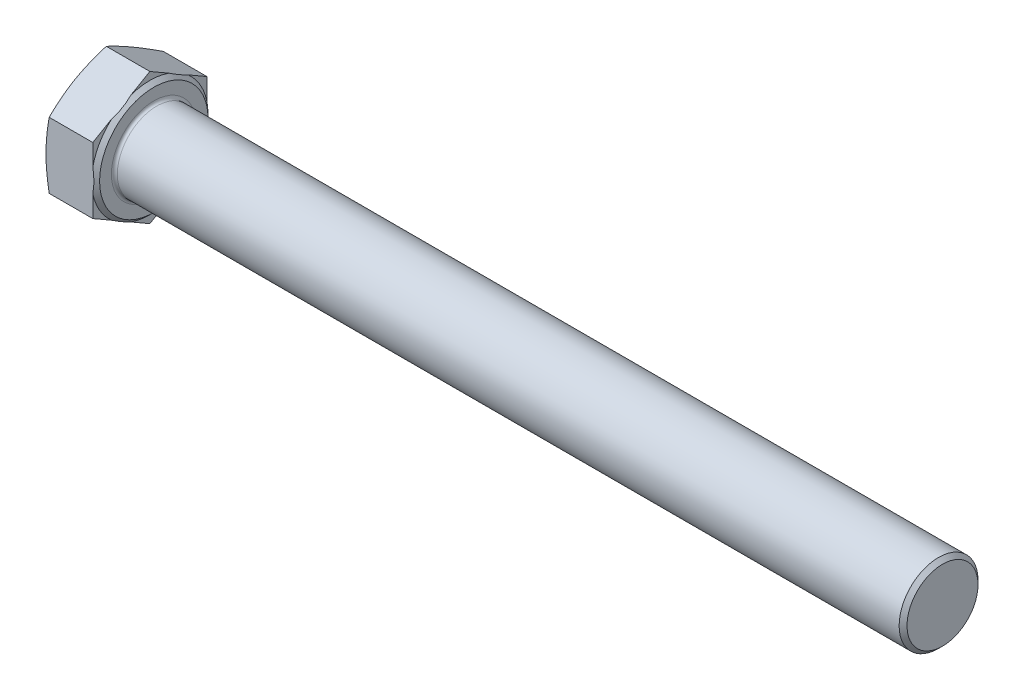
ISO-10303-21;
HEADER;
FILE_DESCRIPTION(('STEP AP214'),'2;1');
FILE_NAME('part.step','',(''),(''),'','','');
FILE_SCHEMA(('AUTOMOTIVE_DESIGN { 1 0 10303 214 1 1 1 1 }'));
ENDSEC;
DATA;
#1=APPLICATION_CONTEXT('core data for automotive mechanical design processes');
#2=APPLICATION_PROTOCOL_DEFINITION('international standard','automotive_design',2000,#1);
#3=PRODUCT_CONTEXT('',#1,'mechanical');
#4=PRODUCT('Part','Part','',(#3));
#5=PRODUCT_RELATED_PRODUCT_CATEGORY('part','',(#4));
#6=PRODUCT_DEFINITION_FORMATION('','',#4);
#7=PRODUCT_DEFINITION_CONTEXT('part definition',#1,'design');
#8=PRODUCT_DEFINITION('design','',#6,#7);
#9=PRODUCT_DEFINITION_SHAPE('','',#8);
#10=(LENGTH_UNIT() NAMED_UNIT(*) SI_UNIT(.MILLI.,.METRE.));
#11=(NAMED_UNIT(*) PLANE_ANGLE_UNIT() SI_UNIT($,.RADIAN.));
#12=(NAMED_UNIT(*) SI_UNIT($,.STERADIAN.) SOLID_ANGLE_UNIT());
#13=UNCERTAINTY_MEASURE_WITH_UNIT(LENGTH_MEASURE(1.E-05),#10,'distance_accuracy_value','');
#14=(GEOMETRIC_REPRESENTATION_CONTEXT(3) GLOBAL_UNCERTAINTY_ASSIGNED_CONTEXT((#13)) GLOBAL_UNIT_ASSIGNED_CONTEXT((#10,
#11,#12)) REPRESENTATION_CONTEXT('',''));
#15=CARTESIAN_POINT('',(0.,0.,0.));
#16=DIRECTION('',(0.,0.,1.));
#17=DIRECTION('',(1.,0.,0.));
#18=AXIS2_PLACEMENT_3D('',#15,#16,#17);
#19=CARTESIAN_POINT('',(10.29,-13.3714322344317,0.));
#20=DIRECTION('',(-1.,0.,0.));
#21=DIRECTION('',(0.,0.,1.));
#22=AXIS2_PLACEMENT_3D('',#19,#20,#21);
#23=PLANE('',#22);
#24=CARTESIAN_POINT('',(10.29,0.,0.));
#25=DIRECTION('',(-1.,0.,0.));
#26=DIRECTION('',(0.,0.,1.));
#27=AXIS2_PLACEMENT_3D('',#24,#25,#26);
#28=CIRCLE('',#27,8.6);
#29=CARTESIAN_POINT('',(10.29,0.,8.6));
#30=VERTEX_POINT('',#29);
#31=EDGE_CURVE('E11',#30,#30,#28,.T.);
#32=ORIENTED_EDGE('',*,*,#31,.T.);
#33=EDGE_LOOP('',(#32));
#34=FACE_BOUND('',#33,.T.);
#35=CARTESIAN_POINT('',(10.29,0.,0.));
#36=DIRECTION('',(-1.,0.,0.));
#37=DIRECTION('',(0.,0.,1.));
#38=AXIS2_PLACEMENT_3D('',#35,#36,#37);
#39=CIRCLE('',#38,11.);
#40=CARTESIAN_POINT('',(10.29,0.,11.));
#41=VERTEX_POINT('',#40);
#42=EDGE_CURVE('E560',#41,#41,#39,.T.);
#43=ORIENTED_EDGE('',*,*,#42,.F.);
#44=EDGE_LOOP('',(#43));
#45=FACE_BOUND('',#44,.T.);
#46=ADVANCED_FACE('F34',(#34,#45),#23,.F.);
#47=CARTESIAN_POINT('',(10.29,-13.3714322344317,0.));
#48=DIRECTION('',(0.,0.866025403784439,0.5));
#49=DIRECTION('',(0.,-0.5,0.866025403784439));
#50=AXIS2_PLACEMENT_3D('',#47,#48,#49);
#51=PLANE('',#50);
#52=CARTESIAN_POINT('',(0.652070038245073,-6.68560064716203,-11.5802));
#53=CARTESIAN_POINT('',(0.551258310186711,-6.9624803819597,-11.1006302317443));
#54=CARTESIAN_POINT('',(0.459552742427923,-7.24027312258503,-10.6194790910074));
#55=CARTESIAN_POINT('',(0.29821116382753,-7.79766476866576,-9.6540484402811));
#56=CARTESIAN_POINT('',(0.228592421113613,-8.07726491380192,-9.16976678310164));
#57=CARTESIAN_POINT('',(0.11598616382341,-8.63516857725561,-8.20344929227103));
#58=CARTESIAN_POINT('',(0.0727530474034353,-8.91345935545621,-7.72143552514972));
#59=CARTESIAN_POINT('',(0.0147653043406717,-9.47069166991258,-6.75628084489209));
#60=CARTESIAN_POINT('',(0.,-9.74963292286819,-6.27314042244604));
#61=CARTESIAN_POINT('',(0.,-10.3075154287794,-5.30685957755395));
#62=CARTESIAN_POINT('',(0.0147653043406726,-10.586456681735,-4.82371915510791));
#63=CARTESIAN_POINT('',(0.0727530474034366,-11.1436889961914,-3.85856447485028));
#64=CARTESIAN_POINT('',(0.115986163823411,-11.421979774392,-3.37655070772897));
#65=CARTESIAN_POINT('',(0.228592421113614,-11.9798834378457,-2.41023321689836));
#66=CARTESIAN_POINT('',(0.29821116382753,-12.2594835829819,-1.92595155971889));
#67=CARTESIAN_POINT('',(0.459552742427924,-12.8168752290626,-0.960520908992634));
#68=CARTESIAN_POINT('',(0.551258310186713,-13.0946679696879,-0.479369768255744));
#69=CARTESIAN_POINT('',(0.652070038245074,-13.3715477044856,0.000200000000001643));
#70=B_SPLINE_CURVE_WITH_KNOTS('',3,(#52,#53,#54,#55,#56,#57,#58,#59,#60,#61,#62,#63,#64,#65,#66,
#67,#68,#69),.UNSPECIFIED.,.F.,.F.,(4,2,2,2,2,2,2,2,4),(0.,1.68875729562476,3.37883167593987,
5.0529245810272,6.72638944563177,8.39985431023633,10.0739472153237,11.7640215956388,
13.4527788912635),.UNSPECIFIED.);
#71=CARTESIAN_POINT('',(0.652028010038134,-6.68571611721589,-11.58));
#72=VERTEX_POINT('',#71);
#73=CARTESIAN_POINT('',(0.,-10.0285741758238,-5.79));
#74=VERTEX_POINT('',#73);
#75=EDGE_CURVE('E150',#72,#74,#70,.T.);
#76=ORIENTED_EDGE('',*,*,#75,.F.);
#77=DIRECTION('',(-1.,0.,0.));
#78=VECTOR('',#77,1.);
#79=CARTESIAN_POINT('',(10.29,-6.68571611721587,-11.58));
#80=LINE('',#79,#78);
#81=CARTESIAN_POINT('',(9.49,-6.68571611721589,-11.58));
#82=VERTEX_POINT('',#81);
#83=EDGE_CURVE('E179',#82,#72,#80,.T.);
#84=ORIENTED_EDGE('',*,*,#83,.F.);
#85=DIRECTION('',(0.,0.5,-0.866025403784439));
#86=VECTOR('',#85,1.);
#87=CARTESIAN_POINT('',(9.49,-13.3714322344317,0.));
#88=LINE('',#87,#86);
#89=CARTESIAN_POINT('',(9.49,-8.89459886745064,-7.75410284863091));
#90=VERTEX_POINT('',#89);
#91=EDGE_CURVE('E313',#90,#82,#88,.T.);
#92=ORIENTED_EDGE('',*,*,#91,.F.);
#93=CARTESIAN_POINT('',(9.48979999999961,-11.1630696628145,-3.82499617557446));
#94=CARTESIAN_POINT('',(9.5175733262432,-11.0908585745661,-3.95006944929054));
#95=CARTESIAN_POINT('',(9.54287548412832,-11.0184140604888,-4.07554702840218));
#96=CARTESIAN_POINT('',(9.58834130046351,-10.8731166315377,-4.32720955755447));
#97=CARTESIAN_POINT('',(9.60850447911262,-10.8002636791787,-4.45339457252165));
#98=CARTESIAN_POINT('',(9.66099226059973,-10.5811662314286,-4.83288248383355));
#99=CARTESIAN_POINT('',(9.6853020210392,-10.434416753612,-5.08706003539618));
#100=CARTESIAN_POINT('',(9.71138230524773,-10.1424770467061,-5.59271444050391));
#101=CARTESIAN_POINT('',(9.71346189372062,-9.99729355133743,-5.84417963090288));
#102=CARTESIAN_POINT('',(9.69580824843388,-9.70732033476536,-6.34642797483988));
#103=CARTESIAN_POINT('',(9.67608586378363,-9.56253045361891,-6.59721140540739));
#104=CARTESIAN_POINT('',(9.62747524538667,-9.33061919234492,-6.99889349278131));
#105=CARTESIAN_POINT('',(9.60520780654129,-9.24313431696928,-7.15042174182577));
#106=CARTESIAN_POINT('',(9.55311273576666,-9.06834298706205,-7.45316920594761));
#107=CARTESIAN_POINT('',(9.5232529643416,-8.98103892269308,-7.60438428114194));
#108=CARTESIAN_POINT('',(9.4898,-8.89407868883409,-7.75500382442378));
#109=B_SPLINE_CURVE_WITH_KNOTS('',3,(#93,#94,#95,#96,#97,#98,#99,#100,#101,#102,#103,#104,#105,
#106,#107,#108),.UNSPECIFIED.,.F.,.F.,(4,2,2,2,2,2,2,4),(0.,0.441163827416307,0.882368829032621,
1.76498378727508,2.63531157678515,3.50520646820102,4.03420282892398,4.56547691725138),.UNSPECIFIED.);
#110=CARTESIAN_POINT('',(9.49,-11.162549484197,-3.8258971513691));
#111=VERTEX_POINT('',#110);
#112=EDGE_CURVE('E300',#111,#90,#109,.T.);
#113=ORIENTED_EDGE('',*,*,#112,.F.);
#114=CARTESIAN_POINT('',(9.49,-13.3714322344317,0.));
#115=VERTEX_POINT('',#114);
#116=EDGE_CURVE('E310',#115,#111,#88,.T.);
#117=ORIENTED_EDGE('',*,*,#116,.F.);
#118=DIRECTION('',(-1.,0.,0.));
#119=VECTOR('',#118,1.);
#120=CARTESIAN_POINT('',(10.29,-13.3714322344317,0.));
#121=LINE('',#120,#119);
#122=CARTESIAN_POINT('',(0.652028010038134,-13.3714322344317,0.));
#123=VERTEX_POINT('',#122);
#124=EDGE_CURVE('E173',#115,#123,#121,.T.);
#125=ORIENTED_EDGE('',*,*,#124,.T.);
#126=EDGE_CURVE('E269',#74,#123,#70,.T.);
#127=ORIENTED_EDGE('',*,*,#126,.F.);
#128=EDGE_LOOP('',(#76,#84,#92,#113,#117,#125,#127));
#129=FACE_BOUND('',#128,.T.);
#130=ADVANCED_FACE('F36',(#129),#51,.F.);
#131=CARTESIAN_POINT('',(10.29,-6.68571611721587,-11.58));
#132=DIRECTION('',(0.,0.,1.));
#133=DIRECTION('',(0.,-1.,0.));
#134=AXIS2_PLACEMENT_3D('',#131,#132,#133);
#135=PLANE('',#134);
#136=CARTESIAN_POINT('',(3.48417910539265,-17.7014254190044,-11.58));
#137=CARTESIAN_POINT('',(3.32464533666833,-17.1775043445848,-11.58));
#138=CARTESIAN_POINT('',(3.16697311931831,-16.6530058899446,-11.58));
#139=CARTESIAN_POINT('',(2.85638159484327,-15.6025602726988,-11.58));
#140=CARTESIAN_POINT('',(2.70346266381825,-15.0766129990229,-11.58));
#141=CARTESIAN_POINT('',(2.40315314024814,-14.022075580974,-11.58));
#142=CARTESIAN_POINT('',(2.25577339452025,-13.4934823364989,-11.58));
#143=CARTESIAN_POINT('',(1.96826765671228,-12.4343295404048,-11.58));
#144=CARTESIAN_POINT('',(1.82814153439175,-11.903770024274,-11.58));
#145=CARTESIAN_POINT('',(1.55861137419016,-10.846887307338,-11.58));
#146=CARTESIAN_POINT('',(1.42909643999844,-10.3205925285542,-11.58));
#147=CARTESIAN_POINT('',(1.18109321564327,-9.26538406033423,-11.58));
#148=CARTESIAN_POINT('',(1.06260511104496,-8.73647032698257,-11.58));
#149=CARTESIAN_POINT('',(0.839417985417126,-7.67590559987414,-11.58));
#150=CARTESIAN_POINT('',(0.734714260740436,-7.14425560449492,-11.58));
#151=CARTESIAN_POINT('',(0.542284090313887,-6.07786901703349,-11.58));
#152=CARTESIAN_POINT('',(0.454557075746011,-5.54313252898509,-11.58));
#153=CARTESIAN_POINT('',(0.308330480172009,-4.53078638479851,-11.58));
#154=CARTESIAN_POINT('',(0.24765673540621,-4.05349372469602,-11.58));
#155=CARTESIAN_POINT('',(0.144950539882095,-3.09689017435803,-11.58));
#156=CARTESIAN_POINT('',(0.102917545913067,-2.61757934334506,-11.58));
#157=CARTESIAN_POINT('',(0.0395170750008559,-1.65791167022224,-11.58));
#158=CARTESIAN_POINT('',(0.0181349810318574,-1.17755580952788,-11.58));
#159=CARTESIAN_POINT('',(-0.00288111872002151,-0.216363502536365,-11.58));
#160=CARTESIAN_POINT('',(-0.00251527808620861,0.264472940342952,-11.58));
#161=CARTESIAN_POINT('',(0.0200015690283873,1.22806689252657,-11.58));
#162=CARTESIAN_POINT('',(0.0422630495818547,1.71082177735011,-11.58));
#163=CARTESIAN_POINT('',(0.107546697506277,2.67491357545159,-11.58));
#164=CARTESIAN_POINT('',(0.150569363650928,3.15625045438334,-11.58));
#165=CARTESIAN_POINT('',(0.25536280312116,4.11726856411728,-11.58));
#166=CARTESIAN_POINT('',(0.317149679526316,4.59694801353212,-11.58));
#167=CARTESIAN_POINT('',(0.45696529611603,5.55390719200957,-11.58));
#168=CARTESIAN_POINT('',(0.534994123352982,6.03118690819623,-11.58));
#169=CARTESIAN_POINT('',(0.709244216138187,7.00846203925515,-11.58));
#170=CARTESIAN_POINT('',(0.806209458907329,7.50832361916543,-11.58));
#171=CARTESIAN_POINT('',(1.01261994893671,8.50547987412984,-11.58));
#172=CARTESIAN_POINT('',(1.12206613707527,9.00277435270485,-11.58));
#173=CARTESIAN_POINT('',(1.35114036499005,9.99515077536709,-11.58));
#174=CARTESIAN_POINT('',(1.47077136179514,10.49023203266,-11.58));
#175=CARTESIAN_POINT('',(1.71826918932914,11.4783089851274,-11.58));
#176=CARTESIAN_POINT('',(1.84613582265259,11.9713047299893,-11.58));
#177=CARTESIAN_POINT('',(2.10873390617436,12.9561361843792,-11.58));
#178=CARTESIAN_POINT('',(2.24347396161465,13.4479695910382,-11.58));
#179=CARTESIAN_POINT('',(2.51843547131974,14.430099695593,-11.58));
#180=CARTESIAN_POINT('',(2.65865694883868,14.92039638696,-11.58));
#181=CARTESIAN_POINT('',(2.94357598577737,15.899593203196,-11.58));
#182=CARTESIAN_POINT('',(3.08827277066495,16.3884935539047,-11.58));
#183=CARTESIAN_POINT('',(3.38139430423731,17.3651766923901,-11.58));
#184=CARTESIAN_POINT('',(3.52981907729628,17.8529594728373,-11.58));
#185=CARTESIAN_POINT('',(3.97640883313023,19.3041150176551,-11.58));
#186=CARTESIAN_POINT('',(4.27906740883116,20.266104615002,-11.58));
#187=CARTESIAN_POINT('',(4.8929613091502,22.1873801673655,-11.58));
#188=CARTESIAN_POINT('',(5.20419704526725,23.1466659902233,-11.58));
#189=CARTESIAN_POINT('',(5.83176520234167,25.0595355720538,-11.58));
#190=CARTESIAN_POINT('',(6.14807380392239,26.0131271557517,-11.58));
#191=CARTESIAN_POINT('',(6.62604550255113,27.4422952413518,-11.58));
#192=CARTESIAN_POINT('',(6.7859476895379,27.9184622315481,-11.58));
#193=CARTESIAN_POINT('',(7.10678674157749,28.8704462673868,-11.58));
#194=CARTESIAN_POINT('',(7.26772360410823,29.3462633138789,-11.58));
#195=CARTESIAN_POINT('',(7.4291086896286,29.8219283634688,-11.58));
#196=B_SPLINE_CURVE_WITH_KNOTS('',3,(#136,#137,#138,#139,#140,#141,#142,#143,#144,#145,#146,
#147,#148,#149,#150,#151,#152,#153,#154,#155,#156,#157,#158,#159,#160,#161,#162,#163,#164,#165,
#166,#167,#168,#169,#170,#171,#172,#173,#174,#175,#176,#177,#178,#179,#180,#181,#182,#183,#184,
#185,#186,#187,#188,#189,#190,#191,#192,#193,#194,#195),.UNSPECIFIED.,.F.,.F.,(4,2,2,2,2,2,2,2,
2,2,2,2,2,2,2,2,2,2,2,2,2,2,2,2,2,2,2,2,2,4),(0.,1.64302680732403,3.28618328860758,
4.93240549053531,6.57859812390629,8.20449405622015,9.83041734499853,11.4557843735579,
13.0810969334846,14.5241809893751,15.9672229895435,17.4092428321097,18.8512524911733,
20.3005753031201,21.7499329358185,23.2005379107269,24.6511506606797,26.1784940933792,
27.7059527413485,29.2338563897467,30.7617234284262,32.2915526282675,33.8213883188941,
35.3509607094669,36.8805431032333,39.9059092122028,42.9314207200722,45.9454524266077,
47.4523468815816,48.959237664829),.UNSPECIFIED.);
#197=CARTESIAN_POINT('',(0.652028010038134,6.68571611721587,-11.58));
#198=VERTEX_POINT('',#197);
#199=CARTESIAN_POINT('',(0.,0.,-11.58));
#200=VERTEX_POINT('',#199);
#201=EDGE_CURVE('E280',#198,#200,#196,.F.);
#202=ORIENTED_EDGE('',*,*,#201,.F.);
#203=DIRECTION('',(-1.,0.,0.));
#204=VECTOR('',#203,1.);
#205=CARTESIAN_POINT('',(10.29,6.68571611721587,-11.58));
#206=LINE('',#205,#204);
#207=CARTESIAN_POINT('',(9.49,6.68571611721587,-11.58));
#208=VERTEX_POINT('',#207);
#209=EDGE_CURVE('E170',#208,#198,#206,.T.);
#210=ORIENTED_EDGE('',*,*,#209,.F.);
#211=DIRECTION('',(0.,1.,0.));
#212=VECTOR('',#211,1.);
#213=CARTESIAN_POINT('',(9.49,-6.68571611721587,-11.58));
#214=LINE('',#213,#212);
#215=CARTESIAN_POINT('',(9.49,2.26795061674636,-11.58));
#216=VERTEX_POINT('',#215);
#217=EDGE_CURVE('E321',#216,#208,#214,.T.);
#218=ORIENTED_EDGE('',*,*,#217,.F.);
#219=CARTESIAN_POINT('',(8.1059848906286,-6.3025276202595,-11.58));
#220=CARTESIAN_POINT('',(8.19456267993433,-6.11721854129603,-11.58));
#221=CARTESIAN_POINT('',(8.28069856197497,-5.93074578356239,-11.58));
#222=CARTESIAN_POINT('',(8.44750919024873,-5.55531369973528,-11.58));
#223=CARTESIAN_POINT('',(8.52818239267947,-5.36635368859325,-11.58));
#224=CARTESIAN_POINT('',(8.76151588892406,-4.79456495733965,-11.58));
#225=CARTESIAN_POINT('',(8.904972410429,-4.40789451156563,-11.58));
#226=CARTESIAN_POINT('',(9.16081551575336,-3.62709151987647,-11.58));
#227=CARTESIAN_POINT('',(9.2733981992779,-3.23302390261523,-11.58));
#228=CARTESIAN_POINT('',(9.46270577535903,-2.43670085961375,-11.58));
#229=CARTESIAN_POINT('',(9.53947742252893,-2.03445682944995,-11.58));
#230=CARTESIAN_POINT('',(9.63588563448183,-1.34267424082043,-11.58));
#231=CARTESIAN_POINT('',(9.665660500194,-1.05452972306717,-11.58));
#232=CARTESIAN_POINT('',(9.70377201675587,-0.476758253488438,-11.58));
#233=CARTESIAN_POINT('',(9.71210613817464,-0.187131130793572,-11.58));
#234=CARTESIAN_POINT('',(9.70698700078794,0.392086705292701,-11.58));
#235=CARTESIAN_POINT('',(9.69352128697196,0.681677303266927,-11.58));
#236=CARTESIAN_POINT('',(9.64530885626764,1.25903810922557,-11.58));
#237=CARTESIAN_POINT('',(9.61056471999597,1.54680853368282,-11.58));
#238=CARTESIAN_POINT('',(9.53237546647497,2.04696573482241,-11.58));
#239=CARTESIAN_POINT('',(9.49333586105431,2.26005740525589,-11.58));
#240=CARTESIAN_POINT('',(9.40481435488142,2.68407135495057,-11.58));
#241=CARTESIAN_POINT('',(9.35533131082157,2.89499339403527,-11.58));
#242=CARTESIAN_POINT('',(9.19229567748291,3.52454425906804,-11.58));
#243=CARTESIAN_POINT('',(9.0642381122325,3.93945806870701,-11.58));
#244=CARTESIAN_POINT('',(8.77584192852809,4.75985487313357,-11.58));
#245=CARTESIAN_POINT('',(8.61535535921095,5.16528478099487,-11.58));
#246=CARTESIAN_POINT('',(8.35586320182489,5.76434731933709,-11.58));
#247=CARTESIAN_POINT('',(8.26640507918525,5.96219558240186,-11.58));
#248=CARTESIAN_POINT('',(8.08186878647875,6.35518465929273,-11.58));
#249=CARTESIAN_POINT('',(7.98679230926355,6.55032626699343,-11.58));
#250=CARTESIAN_POINT('',(7.88922367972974,6.74421277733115,-11.58));
#251=B_SPLINE_CURVE_WITH_KNOTS('',3,(#219,#220,#221,#222,#223,#224,#225,#226,#227,#228,#229,
#230,#231,#232,#233,#234,#235,#236,#237,#238,#239,#240,#241,#242,#243,#244,#245,#246,#247,#248,
#249,#250),.UNSPECIFIED.,.F.,.F.,(4,2,2,2,2,2,2,2,2,2,2,2,2,2,2,4),(0.,0.616139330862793,
1.23245206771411,2.46862938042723,3.69676281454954,4.92328828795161,5.79159704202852,
6.66000822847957,7.52891574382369,8.39771790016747,9.0473674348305,9.69708812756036,
10.9980423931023,12.3050717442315,12.9563967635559,13.6075265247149),.UNSPECIFIED.);
#252=CARTESIAN_POINT('',(9.49,-2.26795061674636,-11.58));
#253=VERTEX_POINT('',#252);
#254=EDGE_CURVE('E294',#253,#216,#251,.T.);
#255=ORIENTED_EDGE('',*,*,#254,.F.);
#256=EDGE_CURVE('E322',#82,#253,#214,.T.);
#257=ORIENTED_EDGE('',*,*,#256,.F.);
#258=ORIENTED_EDGE('',*,*,#83,.T.);
#259=EDGE_CURVE('E161',#200,#72,#196,.F.);
#260=ORIENTED_EDGE('',*,*,#259,.F.);
#261=EDGE_LOOP('',(#202,#210,#218,#255,#257,#258,#260));
#262=FACE_BOUND('',#261,.T.);
#263=ADVANCED_FACE('F217',(#262),#135,.F.);
#264=CARTESIAN_POINT('',(10.29,6.68571611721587,-11.58));
#265=DIRECTION('',(0.,-0.866025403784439,0.5));
#266=DIRECTION('',(0.,-0.5,-0.866025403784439));
#267=AXIS2_PLACEMENT_3D('',#264,#265,#266);
#268=PLANE('',#267);
#269=CARTESIAN_POINT('',(0.652070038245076,13.3715477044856,0.000199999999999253));
#270=CARTESIAN_POINT('',(0.551258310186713,13.0946679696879,-0.479369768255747));
#271=CARTESIAN_POINT('',(0.459552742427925,12.8168752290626,-0.960520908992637));
#272=CARTESIAN_POINT('',(0.298211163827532,12.2594835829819,-1.9259515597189));
#273=CARTESIAN_POINT('',(0.228592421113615,11.9798834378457,-2.41023321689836));
#274=CARTESIAN_POINT('',(0.115986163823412,11.421979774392,-3.37655070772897));
#275=CARTESIAN_POINT('',(0.0727530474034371,11.1436889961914,-3.85856447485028));
#276=CARTESIAN_POINT('',(0.014765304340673,10.586456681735,-4.82371915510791));
#277=CARTESIAN_POINT('',(0.,10.3075154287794,-5.30685957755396));
#278=CARTESIAN_POINT('',(0.,9.74963292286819,-6.27314042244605));
#279=CARTESIAN_POINT('',(0.0147653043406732,9.47069166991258,-6.75628084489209));
#280=CARTESIAN_POINT('',(0.072753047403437,8.91345935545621,-7.72143552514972));
#281=CARTESIAN_POINT('',(0.115986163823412,8.63516857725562,-8.20344929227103));
#282=CARTESIAN_POINT('',(0.228592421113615,8.07726491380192,-9.16976678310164));
#283=CARTESIAN_POINT('',(0.298211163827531,7.79766476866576,-9.6540484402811));
#284=CARTESIAN_POINT('',(0.459552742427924,7.24027312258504,-10.6194790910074));
#285=CARTESIAN_POINT('',(0.551258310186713,6.9624803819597,-11.1006302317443));
#286=CARTESIAN_POINT('',(0.652070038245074,6.68560064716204,-11.5802));
#287=B_SPLINE_CURVE_WITH_KNOTS('',3,(#269,#270,#271,#272,#273,#274,#275,#276,#277,#278,#279,
#280,#281,#282,#283,#284,#285,#286),.UNSPECIFIED.,.F.,.F.,(4,2,2,2,2,2,2,2,4),(0.,
1.68875729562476,3.37883167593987,5.05292458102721,6.72638944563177,8.39985431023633,
10.0739472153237,11.7640215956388,13.4527788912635),.UNSPECIFIED.);
#288=CARTESIAN_POINT('',(0.652028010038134,13.3714322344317,0.));
#289=VERTEX_POINT('',#288);
#290=CARTESIAN_POINT('',(0.,10.0285741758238,-5.79));
#291=VERTEX_POINT('',#290);
#292=EDGE_CURVE('E559',#289,#291,#287,.T.);
#293=ORIENTED_EDGE('',*,*,#292,.F.);
#294=DIRECTION('',(-1.,0.,0.));
#295=VECTOR('',#294,1.);
#296=CARTESIAN_POINT('',(10.29,13.3714322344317,0.));
#297=LINE('',#296,#295);
#298=CARTESIAN_POINT('',(9.49,13.3714322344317,0.));
#299=VERTEX_POINT('',#298);
#300=EDGE_CURVE('E167',#299,#289,#297,.T.);
#301=ORIENTED_EDGE('',*,*,#300,.F.);
#302=DIRECTION('',(0.,0.5,0.866025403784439));
#303=VECTOR('',#302,1.);
#304=CARTESIAN_POINT('',(9.49,6.68571611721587,-11.58));
#305=LINE('',#304,#303);
#306=CARTESIAN_POINT('',(9.49,11.162549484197,-3.82589715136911));
#307=VERTEX_POINT('',#306);
#308=EDGE_CURVE('E318',#307,#299,#305,.T.);
#309=ORIENTED_EDGE('',*,*,#308,.F.);
#310=CARTESIAN_POINT('',(9.4898,8.8940786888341,-7.75500382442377));
#311=CARTESIAN_POINT('',(9.51757332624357,8.9662897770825,-7.62993055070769));
#312=CARTESIAN_POINT('',(9.54287548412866,9.03873429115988,-7.50445297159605));
#313=CARTESIAN_POINT('',(9.5883413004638,9.18403172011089,-7.25279044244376));
#314=CARTESIAN_POINT('',(9.60850447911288,9.25688467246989,-7.12660542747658));
#315=CARTESIAN_POINT('',(9.66099226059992,9.47598212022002,-6.74711751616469));
#316=CARTESIAN_POINT('',(9.68530202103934,9.62273159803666,-6.49293996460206));
#317=CARTESIAN_POINT('',(9.71138230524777,9.91467130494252,-5.98728555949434));
#318=CARTESIAN_POINT('',(9.71346189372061,10.0598548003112,-5.73582036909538));
#319=CARTESIAN_POINT('',(9.69580824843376,10.3498280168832,-5.2335720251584));
#320=CARTESIAN_POINT('',(9.67608586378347,10.4946178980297,-4.9827885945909));
#321=CARTESIAN_POINT('',(9.62747524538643,10.7265291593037,-4.58110650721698));
#322=CARTESIAN_POINT('',(9.60520780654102,10.8140140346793,-4.42957825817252));
#323=CARTESIAN_POINT('',(9.55311273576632,10.9888053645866,-4.12683079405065));
#324=CARTESIAN_POINT('',(9.52325296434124,11.0761094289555,-3.97561571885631));
#325=CARTESIAN_POINT('',(9.48979999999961,11.1630696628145,-3.82499617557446));
#326=B_SPLINE_CURVE_WITH_KNOTS('',3,(#310,#311,#312,#313,#314,#315,#316,#317,#318,#319,#320,
#321,#322,#323,#324,#325),.UNSPECIFIED.,.F.,.F.,(4,2,2,2,2,2,2,4),(0.,0.441163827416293,
0.882368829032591,1.76498378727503,2.63531157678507,3.50520646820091,4.03420282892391,
4.56547691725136),.UNSPECIFIED.);
#327=CARTESIAN_POINT('',(9.49,8.89459886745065,-7.7541028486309));
#328=VERTEX_POINT('',#327);
#329=EDGE_CURVE('E301',#328,#307,#326,.T.);
#330=ORIENTED_EDGE('',*,*,#329,.F.);
#331=EDGE_CURVE('E320',#208,#328,#305,.T.);
#332=ORIENTED_EDGE('',*,*,#331,.F.);
#333=ORIENTED_EDGE('',*,*,#209,.T.);
#334=EDGE_CURVE('E281',#291,#198,#287,.T.);
#335=ORIENTED_EDGE('',*,*,#334,.F.);
#336=EDGE_LOOP('',(#293,#301,#309,#330,#332,#333,#335));
#337=FACE_BOUND('',#336,.T.);
#338=ADVANCED_FACE('F289',(#337),#268,.F.);
#339=CARTESIAN_POINT('',(10.29,13.3714322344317,0.));
#340=DIRECTION('',(0.,-0.866025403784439,-0.5));
#341=DIRECTION('',(0.,0.5,-0.866025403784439));
#342=AXIS2_PLACEMENT_3D('',#339,#340,#341);
#343=PLANE('',#342);
#344=CARTESIAN_POINT('',(0.652070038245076,6.68560064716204,11.5802));
#345=CARTESIAN_POINT('',(0.551258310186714,6.9624803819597,11.1006302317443));
#346=CARTESIAN_POINT('',(0.459552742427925,7.24027312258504,10.6194790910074));
#347=CARTESIAN_POINT('',(0.298211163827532,7.79766476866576,9.65404844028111));
#348=CARTESIAN_POINT('',(0.228592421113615,8.07726491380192,9.16976678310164));
#349=CARTESIAN_POINT('',(0.115986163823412,8.63516857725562,8.20344929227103));
#350=CARTESIAN_POINT('',(0.0727530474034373,8.91345935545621,7.72143552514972));
#351=CARTESIAN_POINT('',(0.0147653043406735,9.47069166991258,6.75628084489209));
#352=CARTESIAN_POINT('',(0.,9.74963292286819,6.27314042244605));
#353=CARTESIAN_POINT('',(0.,10.3075154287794,5.30685957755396));
#354=CARTESIAN_POINT('',(0.0147653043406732,10.586456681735,4.82371915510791));
#355=CARTESIAN_POINT('',(0.0727530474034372,11.1436889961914,3.85856447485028));
#356=CARTESIAN_POINT('',(0.115986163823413,11.421979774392,3.37655070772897));
#357=CARTESIAN_POINT('',(0.228592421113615,11.9798834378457,2.41023321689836));
#358=CARTESIAN_POINT('',(0.298211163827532,12.2594835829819,1.9259515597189));
#359=CARTESIAN_POINT('',(0.459552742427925,12.8168752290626,0.960520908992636));
#360=CARTESIAN_POINT('',(0.551258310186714,13.0946679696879,0.479369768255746));
#361=CARTESIAN_POINT('',(0.652070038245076,13.3715477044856,-0.000200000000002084));
#362=B_SPLINE_CURVE_WITH_KNOTS('',3,(#344,#345,#346,#347,#348,#349,#350,#351,#352,#353,#354,
#355,#356,#357,#358,#359,#360,#361),.UNSPECIFIED.,.F.,.F.,(4,2,2,2,2,2,2,2,4),(0.,
1.68875729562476,3.37883167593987,5.05292458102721,6.72638944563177,8.39985431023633,
10.0739472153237,11.7640215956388,13.4527788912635),.UNSPECIFIED.);
#363=CARTESIAN_POINT('',(0.652028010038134,6.68571611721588,11.58));
#364=VERTEX_POINT('',#363);
#365=CARTESIAN_POINT('',(0.,10.0285741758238,5.79));
#366=VERTEX_POINT('',#365);
#367=EDGE_CURVE('E145',#364,#366,#362,.T.);
#368=ORIENTED_EDGE('',*,*,#367,.F.);
#369=DIRECTION('',(-1.,0.,0.));
#370=VECTOR('',#369,1.);
#371=CARTESIAN_POINT('',(10.29,6.68571611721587,11.58));
#372=LINE('',#371,#370);
#373=CARTESIAN_POINT('',(9.49,6.68571611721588,11.58));
#374=VERTEX_POINT('',#373);
#375=EDGE_CURVE('E158',#374,#364,#372,.T.);
#376=ORIENTED_EDGE('',*,*,#375,.F.);
#377=DIRECTION('',(0.,-0.5,0.866025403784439));
#378=VECTOR('',#377,1.);
#379=CARTESIAN_POINT('',(9.49,13.3714322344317,0.));
#380=LINE('',#379,#378);
#381=CARTESIAN_POINT('',(9.49,8.89459886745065,7.7541028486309));
#382=VERTEX_POINT('',#381);
#383=EDGE_CURVE('E315',#382,#374,#380,.T.);
#384=ORIENTED_EDGE('',*,*,#383,.F.);
#385=CARTESIAN_POINT('',(9.4898,11.1630696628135,3.82499617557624));
#386=CARTESIAN_POINT('',(9.51757332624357,11.0908585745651,3.95006944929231));
#387=CARTESIAN_POINT('',(9.54287548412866,11.0184140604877,4.07554702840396));
#388=CARTESIAN_POINT('',(9.5883413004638,10.8731166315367,4.32720955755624));
#389=CARTESIAN_POINT('',(9.60850447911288,10.8002636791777,4.45339457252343));
#390=CARTESIAN_POINT('',(9.66099226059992,10.5811662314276,4.83288248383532));
#391=CARTESIAN_POINT('',(9.68530202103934,10.4344167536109,5.08706003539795));
#392=CARTESIAN_POINT('',(9.71138230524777,10.1424770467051,5.59271444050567));
#393=CARTESIAN_POINT('',(9.71346189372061,9.99729355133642,5.84417963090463));
#394=CARTESIAN_POINT('',(9.69580824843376,9.70732033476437,6.34642797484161));
#395=CARTESIAN_POINT('',(9.67608586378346,9.56253045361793,6.5972114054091));
#396=CARTESIAN_POINT('',(9.62747524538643,9.33061919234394,6.99889349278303));
#397=CARTESIAN_POINT('',(9.60520780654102,9.24313431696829,7.15042174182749));
#398=CARTESIAN_POINT('',(9.55311273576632,9.06834298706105,7.45316920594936));
#399=CARTESIAN_POINT('',(9.52325296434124,8.98103892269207,7.6043842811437));
#400=CARTESIAN_POINT('',(9.4897999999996,8.89407868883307,7.75500382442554));
#401=B_SPLINE_CURVE_WITH_KNOTS('',3,(#385,#386,#387,#388,#389,#390,#391,#392,#393,#394,#395,
#396,#397,#398,#399,#400),.UNSPECIFIED.,.F.,.F.,(4,2,2,2,2,2,2,4),(0.,0.441163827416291,
0.882368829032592,1.76498378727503,2.63531157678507,3.50520646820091,4.03420282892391,
4.56547691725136),.UNSPECIFIED.);
#402=CARTESIAN_POINT('',(9.49,11.162549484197,3.82589715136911));
#403=VERTEX_POINT('',#402);
#404=EDGE_CURVE('E356',#403,#382,#401,.T.);
#405=ORIENTED_EDGE('',*,*,#404,.F.);
#406=EDGE_CURVE('E317',#299,#403,#380,.T.);
#407=ORIENTED_EDGE('',*,*,#406,.F.);
#408=ORIENTED_EDGE('',*,*,#300,.T.);
#409=EDGE_CURVE('E160',#366,#289,#362,.T.);
#410=ORIENTED_EDGE('',*,*,#409,.F.);
#411=EDGE_LOOP('',(#368,#376,#384,#405,#407,#408,#410));
#412=FACE_BOUND('',#411,.T.);
#413=ADVANCED_FACE('F156',(#412),#343,.F.);
#414=CARTESIAN_POINT('',(10.29,6.68571611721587,11.58));
#415=DIRECTION('',(0.,0.,-1.));
#416=DIRECTION('',(-1.,0.,0.));
#417=AXIS2_PLACEMENT_3D('',#414,#415,#416);
#418=PLANE('',#417);
#419=CARTESIAN_POINT('',(3.48417910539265,-17.7014254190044,11.58));
#420=CARTESIAN_POINT('',(3.32464533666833,-17.1775043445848,11.58));
#421=CARTESIAN_POINT('',(3.16697311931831,-16.6530058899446,11.58));
#422=CARTESIAN_POINT('',(2.85638159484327,-15.6025602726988,11.58));
#423=CARTESIAN_POINT('',(2.70346266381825,-15.0766129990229,11.58));
#424=CARTESIAN_POINT('',(2.40315314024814,-14.022075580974,11.58));
#425=CARTESIAN_POINT('',(2.25577339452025,-13.4934823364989,11.58));
#426=CARTESIAN_POINT('',(1.96826765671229,-12.4343295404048,11.58));
#427=CARTESIAN_POINT('',(1.82814153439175,-11.903770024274,11.58));
#428=CARTESIAN_POINT('',(1.55861137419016,-10.846887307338,11.58));
#429=CARTESIAN_POINT('',(1.42909643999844,-10.3205925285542,11.58));
#430=CARTESIAN_POINT('',(1.18109321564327,-9.26538406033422,11.58));
#431=CARTESIAN_POINT('',(1.06260511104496,-8.73647032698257,11.58));
#432=CARTESIAN_POINT('',(0.839417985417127,-7.67590559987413,11.58));
#433=CARTESIAN_POINT('',(0.734714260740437,-7.14425560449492,11.58));
#434=CARTESIAN_POINT('',(0.542284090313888,-6.07786901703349,11.58));
#435=CARTESIAN_POINT('',(0.454557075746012,-5.54313252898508,11.58));
#436=CARTESIAN_POINT('',(0.30833048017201,-4.5307863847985,11.58));
#437=CARTESIAN_POINT('',(0.247656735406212,-4.05349372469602,11.58));
#438=CARTESIAN_POINT('',(0.144950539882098,-3.09689017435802,11.58));
#439=CARTESIAN_POINT('',(0.10291754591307,-2.61757934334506,11.58));
#440=CARTESIAN_POINT('',(0.0395170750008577,-1.65791167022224,11.58));
#441=CARTESIAN_POINT('',(0.0181349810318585,-1.17755580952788,11.58));
#442=CARTESIAN_POINT('',(-0.00288111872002,-0.21636350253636,11.58));
#443=CARTESIAN_POINT('',(-0.00251527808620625,0.264472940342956,11.58));
#444=CARTESIAN_POINT('',(0.0200015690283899,1.22806689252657,11.58));
#445=CARTESIAN_POINT('',(0.0422630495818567,1.71082177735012,11.58));
#446=CARTESIAN_POINT('',(0.107546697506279,2.67491357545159,11.58));
#447=CARTESIAN_POINT('',(0.150569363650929,3.15625045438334,11.58));
#448=CARTESIAN_POINT('',(0.255362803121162,4.11726856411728,11.58));
#449=CARTESIAN_POINT('',(0.317149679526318,4.59694801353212,11.58));
#450=CARTESIAN_POINT('',(0.456965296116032,5.55390719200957,11.58));
#451=CARTESIAN_POINT('',(0.534994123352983,6.03118690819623,11.58));
#452=CARTESIAN_POINT('',(0.709244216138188,7.00846203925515,11.58));
#453=CARTESIAN_POINT('',(0.80620945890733,7.50832361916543,11.58));
#454=CARTESIAN_POINT('',(1.01261994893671,8.50547987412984,11.58));
#455=CARTESIAN_POINT('',(1.12206613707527,9.00277435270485,11.58));
#456=CARTESIAN_POINT('',(1.35114036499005,9.99515077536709,11.58));
#457=CARTESIAN_POINT('',(1.47077136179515,10.49023203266,11.58));
#458=CARTESIAN_POINT('',(1.71826918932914,11.4783089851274,11.58));
#459=CARTESIAN_POINT('',(1.84613582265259,11.9713047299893,11.58));
#460=CARTESIAN_POINT('',(2.10873390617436,12.9561361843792,11.58));
#461=CARTESIAN_POINT('',(2.24347396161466,13.4479695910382,11.58));
#462=CARTESIAN_POINT('',(2.51843547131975,14.430099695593,11.58));
#463=CARTESIAN_POINT('',(2.65865694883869,14.92039638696,11.58));
#464=CARTESIAN_POINT('',(2.94357598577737,15.899593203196,11.58));
#465=CARTESIAN_POINT('',(3.08827277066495,16.3884935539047,11.58));
#466=CARTESIAN_POINT('',(3.38139430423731,17.3651766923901,11.58));
#467=CARTESIAN_POINT('',(3.52981907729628,17.8529594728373,11.58));
#468=CARTESIAN_POINT('',(3.97640883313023,19.3041150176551,11.58));
#469=CARTESIAN_POINT('',(4.27906740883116,20.266104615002,11.58));
#470=CARTESIAN_POINT('',(4.8929613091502,22.1873801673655,11.58));
#471=CARTESIAN_POINT('',(5.20419704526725,23.1466659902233,11.58));
#472=CARTESIAN_POINT('',(5.83176520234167,25.0595355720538,11.58));
#473=CARTESIAN_POINT('',(6.14807380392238,26.0131271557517,11.58));
#474=CARTESIAN_POINT('',(6.62604550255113,27.4422952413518,11.58));
#475=CARTESIAN_POINT('',(6.7859476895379,27.9184622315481,11.58));
#476=CARTESIAN_POINT('',(7.10678674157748,28.8704462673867,11.58));
#477=CARTESIAN_POINT('',(7.26772360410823,29.3462633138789,11.58));
#478=CARTESIAN_POINT('',(7.42910868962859,29.8219283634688,11.58));
#479=B_SPLINE_CURVE_WITH_KNOTS('',3,(#419,#420,#421,#422,#423,#424,#425,#426,#427,#428,#429,
#430,#431,#432,#433,#434,#435,#436,#437,#438,#439,#440,#441,#442,#443,#444,#445,#446,#447,#448,
#449,#450,#451,#452,#453,#454,#455,#456,#457,#458,#459,#460,#461,#462,#463,#464,#465,#466,#467,
#468,#469,#470,#471,#472,#473,#474,#475,#476,#477,#478),.UNSPECIFIED.,.F.,.F.,(4,2,2,2,2,2,2,2,
2,2,2,2,2,2,2,2,2,2,2,2,2,2,2,2,2,2,2,2,2,4),(0.,1.64302680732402,3.28618328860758,
4.93240549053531,6.57859812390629,8.20449405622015,9.83041734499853,11.4557843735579,
13.0810969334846,14.5241809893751,15.9672229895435,17.4092428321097,18.8512524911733,
20.3005753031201,21.7499329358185,23.2005379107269,24.6511506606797,26.1784940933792,
27.7059527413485,29.2338563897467,30.7617234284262,32.2915526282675,33.8213883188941,
35.3509607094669,36.8805431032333,39.9059092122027,42.9314207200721,45.9454524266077,
47.4523468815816,48.9592376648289),.UNSPECIFIED.);
#480=CARTESIAN_POINT('',(0.652028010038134,-6.68571611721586,11.58));
#481=VERTEX_POINT('',#480);
#482=CARTESIAN_POINT('',(0.,0.,11.58));
#483=VERTEX_POINT('',#482);
#484=EDGE_CURVE('E152',#481,#483,#479,.T.);
#485=ORIENTED_EDGE('',*,*,#484,.F.);
#486=DIRECTION('',(-1.,0.,0.));
#487=VECTOR('',#486,1.);
#488=CARTESIAN_POINT('',(10.29,-6.68571611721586,11.58));
#489=LINE('',#488,#487);
#490=CARTESIAN_POINT('',(9.49,-6.68571611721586,11.58));
#491=VERTEX_POINT('',#490);
#492=EDGE_CURVE('E168',#491,#481,#489,.T.);
#493=ORIENTED_EDGE('',*,*,#492,.F.);
#494=DIRECTION('',(0.,-1.,0.));
#495=VECTOR('',#494,1.);
#496=CARTESIAN_POINT('',(9.49,6.68571611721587,11.58));
#497=LINE('',#496,#495);
#498=CARTESIAN_POINT('',(9.49,-2.26795061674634,11.58));
#499=VERTEX_POINT('',#498);
#500=EDGE_CURVE('E312',#499,#491,#497,.T.);
#501=ORIENTED_EDGE('',*,*,#500,.F.);
#502=CARTESIAN_POINT('',(8.1059848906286,-6.3025276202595,11.58));
#503=CARTESIAN_POINT('',(8.19456267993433,-6.11721854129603,11.58));
#504=CARTESIAN_POINT('',(8.28069856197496,-5.93074578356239,11.58));
#505=CARTESIAN_POINT('',(8.44750919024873,-5.55531369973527,11.58));
#506=CARTESIAN_POINT('',(8.52818239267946,-5.36635368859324,11.58));
#507=CARTESIAN_POINT('',(8.76151588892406,-4.79456495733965,11.58));
#508=CARTESIAN_POINT('',(8.90497241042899,-4.40789451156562,11.58));
#509=CARTESIAN_POINT('',(9.16081551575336,-3.62709151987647,11.58));
#510=CARTESIAN_POINT('',(9.27339819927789,-3.23302390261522,11.58));
#511=CARTESIAN_POINT('',(9.46270577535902,-2.43670085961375,11.58));
#512=CARTESIAN_POINT('',(9.53947742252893,-2.03445682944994,11.58));
#513=CARTESIAN_POINT('',(9.63588563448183,-1.34267424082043,11.58));
#514=CARTESIAN_POINT('',(9.66566050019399,-1.05452972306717,11.58));
#515=CARTESIAN_POINT('',(9.70377201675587,-0.476758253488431,11.58));
#516=CARTESIAN_POINT('',(9.71210613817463,-0.187131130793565,11.58));
#517=CARTESIAN_POINT('',(9.70698700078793,0.392086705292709,11.58));
#518=CARTESIAN_POINT('',(9.69352128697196,0.681677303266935,11.58));
#519=CARTESIAN_POINT('',(9.64530885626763,1.25903810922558,11.58));
#520=CARTESIAN_POINT('',(9.61056471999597,1.54680853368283,11.58));
#521=CARTESIAN_POINT('',(9.53237546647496,2.04696573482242,11.58));
#522=CARTESIAN_POINT('',(9.4933358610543,2.2600574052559,11.58));
#523=CARTESIAN_POINT('',(9.40481435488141,2.68407135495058,11.58));
#524=CARTESIAN_POINT('',(9.35533131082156,2.89499339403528,11.58));
#525=CARTESIAN_POINT('',(9.19229567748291,3.52454425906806,11.58));
#526=CARTESIAN_POINT('',(9.06423811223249,3.93945806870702,11.58));
#527=CARTESIAN_POINT('',(8.77584192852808,4.75985487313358,11.58));
#528=CARTESIAN_POINT('',(8.61535535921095,5.16528478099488,11.58));
#529=CARTESIAN_POINT('',(8.35586320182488,5.7643473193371,11.58));
#530=CARTESIAN_POINT('',(8.26640507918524,5.96219558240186,11.58));
#531=CARTESIAN_POINT('',(8.08186878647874,6.35518465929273,11.58));
#532=CARTESIAN_POINT('',(7.98679230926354,6.55032626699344,11.58));
#533=CARTESIAN_POINT('',(7.88922367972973,6.74421277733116,11.58));
#534=B_SPLINE_CURVE_WITH_KNOTS('',3,(#502,#503,#504,#505,#506,#507,#508,#509,#510,#511,#512,
#513,#514,#515,#516,#517,#518,#519,#520,#521,#522,#523,#524,#525,#526,#527,#528,#529,#530,#531,
#532,#533),.UNSPECIFIED.,.F.,.F.,(4,2,2,2,2,2,2,2,2,2,2,2,2,2,2,4),(0.,0.616139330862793,
1.23245206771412,2.46862938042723,3.69676281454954,4.92328828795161,5.79159704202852,
6.66000822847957,7.52891574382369,8.39771790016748,9.0473674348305,9.69708812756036,
10.9980423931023,12.3050717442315,12.9563967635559,13.6075265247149),.UNSPECIFIED.);
#535=CARTESIAN_POINT('',(9.49,2.26795061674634,11.58));
#536=VERTEX_POINT('',#535);
#537=EDGE_CURVE('E357',#536,#499,#534,.F.);
#538=ORIENTED_EDGE('',*,*,#537,.F.);
#539=EDGE_CURVE('E166',#374,#536,#497,.T.);
#540=ORIENTED_EDGE('',*,*,#539,.F.);
#541=ORIENTED_EDGE('',*,*,#375,.T.);
#542=EDGE_CURVE('E142',#483,#364,#479,.T.);
#543=ORIENTED_EDGE('',*,*,#542,.F.);
#544=EDGE_LOOP('',(#485,#493,#501,#538,#540,#541,#543));
#545=FACE_BOUND('',#544,.T.);
#546=ADVANCED_FACE('F164',(#545),#418,.F.);
#547=CARTESIAN_POINT('',(10.29,-6.68571611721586,11.58));
#548=DIRECTION('',(0.,0.866025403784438,-0.5));
#549=DIRECTION('',(0.,0.5,0.866025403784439));
#550=AXIS2_PLACEMENT_3D('',#547,#548,#549);
#551=PLANE('',#550);
#552=CARTESIAN_POINT('',(0.652070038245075,-13.3715477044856,-0.000199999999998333));
#553=CARTESIAN_POINT('',(0.551258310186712,-13.0946679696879,0.479369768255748));
#554=CARTESIAN_POINT('',(0.459552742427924,-12.8168752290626,0.960520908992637));
#555=CARTESIAN_POINT('',(0.298211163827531,-12.2594835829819,1.9259515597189));
#556=CARTESIAN_POINT('',(0.228592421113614,-11.9798834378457,2.41023321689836));
#557=CARTESIAN_POINT('',(0.115986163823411,-11.421979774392,3.37655070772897));
#558=CARTESIAN_POINT('',(0.0727530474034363,-11.1436889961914,3.85856447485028));
#559=CARTESIAN_POINT('',(0.014765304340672,-10.586456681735,4.82371915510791));
#560=CARTESIAN_POINT('',(0.,-10.3075154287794,5.30685957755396));
#561=CARTESIAN_POINT('',(0.,-9.74963292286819,6.27314042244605));
#562=CARTESIAN_POINT('',(0.0147653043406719,-9.47069166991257,6.7562808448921));
#563=CARTESIAN_POINT('',(0.0727530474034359,-8.9134593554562,7.72143552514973));
#564=CARTESIAN_POINT('',(0.115986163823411,-8.63516857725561,8.20344929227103));
#565=CARTESIAN_POINT('',(0.228592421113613,-8.07726491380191,9.16976678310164));
#566=CARTESIAN_POINT('',(0.29821116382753,-7.79766476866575,9.65404844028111));
#567=CARTESIAN_POINT('',(0.459552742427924,-7.24027312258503,10.6194790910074));
#568=CARTESIAN_POINT('',(0.551258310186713,-6.96248038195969,11.1006302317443));
#569=CARTESIAN_POINT('',(0.652070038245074,-6.68560064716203,11.5802));
#570=B_SPLINE_CURVE_WITH_KNOTS('',3,(#552,#553,#554,#555,#556,#557,#558,#559,#560,#561,#562,
#563,#564,#565,#566,#567,#568,#569),.UNSPECIFIED.,.F.,.F.,(4,2,2,2,2,2,2,2,4),(0.,
1.68875729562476,3.37883167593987,5.05292458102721,6.72638944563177,8.39985431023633,
10.0739472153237,11.7640215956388,13.4527788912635),.UNSPECIFIED.);
#571=CARTESIAN_POINT('',(0.,-10.0285741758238,5.79000000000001));
#572=VERTEX_POINT('',#571);
#573=EDGE_CURVE('E248',#123,#572,#570,.T.);
#574=ORIENTED_EDGE('',*,*,#573,.F.);
#575=ORIENTED_EDGE('',*,*,#124,.F.);
#576=DIRECTION('',(0.,-0.5,-0.866025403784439));
#577=VECTOR('',#576,1.);
#578=CARTESIAN_POINT('',(9.49,-6.68571611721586,11.58));
#579=LINE('',#578,#577);
#580=CARTESIAN_POINT('',(9.49,-11.162549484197,3.82589715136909));
#581=VERTEX_POINT('',#580);
#582=EDGE_CURVE('E182',#581,#115,#579,.T.);
#583=ORIENTED_EDGE('',*,*,#582,.F.);
#584=CARTESIAN_POINT('',(9.48979999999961,-8.89407868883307,7.75500382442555));
#585=CARTESIAN_POINT('',(9.5175733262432,-8.96628977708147,7.62993055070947));
#586=CARTESIAN_POINT('',(9.54287548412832,-9.03873429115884,7.50445297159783));
#587=CARTESIAN_POINT('',(9.58834130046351,-9.18403172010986,7.25279044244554));
#588=CARTESIAN_POINT('',(9.60850447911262,-9.25688467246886,7.12660542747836));
#589=CARTESIAN_POINT('',(9.66099226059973,-9.47598212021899,6.74711751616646));
#590=CARTESIAN_POINT('',(9.6853020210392,-9.62273159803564,6.49293996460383));
#591=CARTESIAN_POINT('',(9.71138230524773,-9.9146713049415,5.9872855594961));
#592=CARTESIAN_POINT('',(9.71346189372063,-10.0598548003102,5.73582036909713));
#593=CARTESIAN_POINT('',(9.69580824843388,-10.3498280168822,5.23357202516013));
#594=CARTESIAN_POINT('',(9.67608586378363,-10.4946178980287,4.98278859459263));
#595=CARTESIAN_POINT('',(9.62747524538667,-10.7265291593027,4.5811065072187));
#596=CARTESIAN_POINT('',(9.60520780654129,-10.8140140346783,4.42957825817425));
#597=CARTESIAN_POINT('',(9.55311273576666,-10.9888053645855,4.1268307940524));
#598=CARTESIAN_POINT('',(9.5232529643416,-11.0761094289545,3.97561571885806));
#599=CARTESIAN_POINT('',(9.4898,-11.1630696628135,3.82499617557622));
#600=B_SPLINE_CURVE_WITH_KNOTS('',3,(#584,#585,#586,#587,#588,#589,#590,#591,#592,#593,#594,
#595,#596,#597,#598,#599),.UNSPECIFIED.,.F.,.F.,(4,2,2,2,2,2,2,4),(0.,0.441163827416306,
0.88236882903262,1.76498378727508,2.63531157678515,3.50520646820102,4.03420282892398,
4.56547691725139),.UNSPECIFIED.);
#601=CARTESIAN_POINT('',(9.49,-8.89459886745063,7.75410284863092));
#602=VERTEX_POINT('',#601);
#603=EDGE_CURVE('E234',#602,#581,#600,.T.);
#604=ORIENTED_EDGE('',*,*,#603,.F.);
#605=EDGE_CURVE('E184',#491,#602,#579,.T.);
#606=ORIENTED_EDGE('',*,*,#605,.F.);
#607=ORIENTED_EDGE('',*,*,#492,.T.);
#608=EDGE_CURVE('E242',#572,#481,#570,.T.);
#609=ORIENTED_EDGE('',*,*,#608,.F.);
#610=EDGE_LOOP('',(#574,#575,#583,#604,#606,#607,#609));
#611=FACE_BOUND('',#610,.T.);
#612=ADVANCED_FACE('F224',(#611),#551,.F.);
#613=CARTESIAN_POINT('',(9.49,11.8,0.));
#614=DIRECTION('',(1.,0.,0.));
#615=DIRECTION('',(0.,0.,-1.));
#616=AXIS2_PLACEMENT_3D('',#613,#614,#615);
#617=PLANE('',#616);
#618=ORIENTED_EDGE('',*,*,#91,.T.);
#619=ORIENTED_EDGE('',*,*,#256,.T.);
#620=CARTESIAN_POINT('',(9.49,0.,0.));
#621=DIRECTION('',(-1.,0.,0.));
#622=DIRECTION('',(0.,0.,1.));
#623=AXIS2_PLACEMENT_3D('',#620,#621,#622);
#624=CIRCLE('',#623,11.8);
#625=EDGE_CURVE('E332',#253,#90,#624,.T.);
#626=ORIENTED_EDGE('',*,*,#625,.T.);
#627=EDGE_LOOP('',(#618,#619,#626));
#628=FACE_BOUND('',#627,.T.);
#629=ADVANCED_FACE('F228',(#628),#617,.T.);
#630=ORIENTED_EDGE('',*,*,#217,.T.);
#631=ORIENTED_EDGE('',*,*,#331,.T.);
#632=EDGE_CURVE('E340',#328,#216,#624,.T.);
#633=ORIENTED_EDGE('',*,*,#632,.T.);
#634=EDGE_LOOP('',(#630,#631,#633));
#635=FACE_BOUND('',#634,.T.);
#636=ADVANCED_FACE('F347',(#635),#617,.T.);
#637=ORIENTED_EDGE('',*,*,#308,.T.);
#638=ORIENTED_EDGE('',*,*,#406,.T.);
#639=EDGE_CURVE('E575',#403,#307,#624,.T.);
#640=ORIENTED_EDGE('',*,*,#639,.T.);
#641=EDGE_LOOP('',(#637,#638,#640));
#642=FACE_BOUND('',#641,.T.);
#643=ADVANCED_FACE('F423',(#642),#617,.T.);
#644=ORIENTED_EDGE('',*,*,#383,.T.);
#645=ORIENTED_EDGE('',*,*,#539,.T.);
#646=EDGE_CURVE('E572',#536,#382,#624,.T.);
#647=ORIENTED_EDGE('',*,*,#646,.T.);
#648=EDGE_LOOP('',(#644,#645,#647));
#649=FACE_BOUND('',#648,.T.);
#650=ADVANCED_FACE('F414',(#649),#617,.T.);
#651=ORIENTED_EDGE('',*,*,#500,.T.);
#652=ORIENTED_EDGE('',*,*,#605,.T.);
#653=EDGE_CURVE('E571',#602,#499,#624,.T.);
#654=ORIENTED_EDGE('',*,*,#653,.T.);
#655=EDGE_LOOP('',(#651,#652,#654));
#656=FACE_BOUND('',#655,.T.);
#657=ADVANCED_FACE('F405',(#656),#617,.T.);
#658=ORIENTED_EDGE('',*,*,#116,.T.);
#659=EDGE_CURVE('E341',#111,#581,#624,.T.);
#660=ORIENTED_EDGE('',*,*,#659,.T.);
#661=ORIENTED_EDGE('',*,*,#582,.T.);
#662=EDGE_LOOP('',(#658,#660,#661));
#663=FACE_BOUND('',#662,.T.);
#664=ADVANCED_FACE('F394',(#663),#617,.T.);
#665=CARTESIAN_POINT('',(9.49,0.,0.));
#666=DIRECTION('',(-1.,0.,0.));
#667=DIRECTION('',(0.,0.,1.));
#668=AXIS2_PLACEMENT_3D('',#665,#666,#667);
#669=CONICAL_SURFACE('',#668,11.8,0.785398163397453);
#670=ORIENTED_EDGE('',*,*,#42,.T.);
#671=EDGE_LOOP('',(#670));
#672=FACE_BOUND('',#671,.T.);
#673=ORIENTED_EDGE('',*,*,#112,.T.);
#674=ORIENTED_EDGE('',*,*,#625,.F.);
#675=ORIENTED_EDGE('',*,*,#254,.T.);
#676=ORIENTED_EDGE('',*,*,#632,.F.);
#677=ORIENTED_EDGE('',*,*,#329,.T.);
#678=ORIENTED_EDGE('',*,*,#639,.F.);
#679=ORIENTED_EDGE('',*,*,#404,.T.);
#680=ORIENTED_EDGE('',*,*,#646,.F.);
#681=ORIENTED_EDGE('',*,*,#537,.T.);
#682=ORIENTED_EDGE('',*,*,#653,.F.);
#683=ORIENTED_EDGE('',*,*,#603,.T.);
#684=ORIENTED_EDGE('',*,*,#659,.F.);
#685=EDGE_LOOP('',(#673,#674,#675,#676,#677,#678,#679,#680,#681,#682,#683,#684));
#686=FACE_BOUND('',#685,.T.);
#687=ADVANCED_FACE('F261',(#672,#686),#669,.T.);
#688=CARTESIAN_POINT('',(0.,0.,0.));
#689=DIRECTION('',(1.,0.,0.));
#690=DIRECTION('',(0.,0.,-1.));
#691=AXIS2_PLACEMENT_3D('',#688,#689,#690);
#692=CONICAL_SURFACE('',#691,11.58,1.22173047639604);
#693=ORIENTED_EDGE('',*,*,#484,.T.);
#694=CARTESIAN_POINT('',(0.,0.,0.));
#695=DIRECTION('',(-1.,0.,0.));
#696=DIRECTION('',(0.,0.,1.));
#697=AXIS2_PLACEMENT_3D('',#694,#695,#696);
#698=CIRCLE('',#697,11.58);
#699=EDGE_CURVE('E185',#572,#483,#698,.T.);
#700=ORIENTED_EDGE('',*,*,#699,.F.);
#701=ORIENTED_EDGE('',*,*,#608,.T.);
#702=EDGE_LOOP('',(#693,#700,#701));
#703=FACE_BOUND('',#702,.T.);
#704=ADVANCED_FACE('F259',(#703),#692,.T.);
#705=ORIENTED_EDGE('',*,*,#126,.T.);
#706=ORIENTED_EDGE('',*,*,#573,.T.);
#707=EDGE_CURVE('E58',#74,#572,#698,.T.);
#708=ORIENTED_EDGE('',*,*,#707,.F.);
#709=EDGE_LOOP('',(#705,#706,#708));
#710=FACE_BOUND('',#709,.T.);
#711=ADVANCED_FACE('F515',(#710),#692,.T.);
#712=ORIENTED_EDGE('',*,*,#259,.T.);
#713=ORIENTED_EDGE('',*,*,#75,.T.);
#714=EDGE_CURVE('E562',#200,#74,#698,.T.);
#715=ORIENTED_EDGE('',*,*,#714,.F.);
#716=EDGE_LOOP('',(#712,#713,#715));
#717=FACE_BOUND('',#716,.T.);
#718=ADVANCED_FACE('F516',(#717),#692,.T.);
#719=ORIENTED_EDGE('',*,*,#334,.T.);
#720=ORIENTED_EDGE('',*,*,#201,.T.);
#721=EDGE_CURVE('E557',#291,#200,#698,.T.);
#722=ORIENTED_EDGE('',*,*,#721,.F.);
#723=EDGE_LOOP('',(#719,#720,#722));
#724=FACE_BOUND('',#723,.T.);
#725=ADVANCED_FACE('F257',(#724),#692,.T.);
#726=ORIENTED_EDGE('',*,*,#292,.T.);
#727=EDGE_CURVE('E187',#366,#291,#698,.T.);
#728=ORIENTED_EDGE('',*,*,#727,.F.);
#729=ORIENTED_EDGE('',*,*,#409,.T.);
#730=EDGE_LOOP('',(#726,#728,#729));
#731=FACE_BOUND('',#730,.T.);
#732=ADVANCED_FACE('F253',(#731),#692,.T.);
#733=ORIENTED_EDGE('',*,*,#367,.T.);
#734=CARTESIAN_POINT('',(0.,0.,0.));
#735=DIRECTION('',(-1.,0.,0.));
#736=DIRECTION('',(0.,0.,1.));
#737=AXIS2_PLACEMENT_3D('',#734,#735,#736);
#738=CIRCLE('',#737,11.58);
#739=EDGE_CURVE('E50',#483,#366,#738,.T.);
#740=ORIENTED_EDGE('',*,*,#739,.F.);
#741=ORIENTED_EDGE('',*,*,#542,.T.);
#742=EDGE_LOOP('',(#733,#740,#741));
#743=FACE_BOUND('',#742,.T.);
#744=ADVANCED_FACE('F144',(#743),#692,.T.);
#745=CARTESIAN_POINT('',(0.,-13.3714322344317,0.));
#746=DIRECTION('',(-1.,0.,0.));
#747=DIRECTION('',(0.,0.,1.));
#748=AXIS2_PLACEMENT_3D('',#745,#746,#747);
#749=PLANE('',#748);
#750=ORIENTED_EDGE('',*,*,#699,.T.);
#751=ORIENTED_EDGE('',*,*,#739,.T.);
#752=ORIENTED_EDGE('',*,*,#727,.T.);
#753=ORIENTED_EDGE('',*,*,#721,.T.);
#754=ORIENTED_EDGE('',*,*,#714,.T.);
#755=ORIENTED_EDGE('',*,*,#707,.T.);
#756=EDGE_LOOP('',(#750,#751,#752,#753,#754,#755));
#757=FACE_BOUND('',#756,.T.);
#758=ADVANCED_FACE('F222',(#757),#749,.T.);
#759=CARTESIAN_POINT('',(170.29,0.,0.));
#760=DIRECTION('',(-1.,0.,0.));
#761=DIRECTION('',(0.,0.,1.));
#762=AXIS2_PLACEMENT_3D('',#759,#760,#761);
#763=CYLINDRICAL_SURFACE('',#762,8.);
#764=CARTESIAN_POINT('',(10.89,0.,0.));
#765=DIRECTION('',(-1.,0.,0.));
#766=DIRECTION('',(0.,0.,1.));
#767=AXIS2_PLACEMENT_3D('',#764,#765,#766);
#768=CIRCLE('',#767,8.);
#769=CARTESIAN_POINT('',(10.89,0.,8.));
#770=VERTEX_POINT('',#769);
#771=EDGE_CURVE('E43',#770,#770,#768,.F.);
#772=ORIENTED_EDGE('',*,*,#771,.T.);
#773=EDGE_LOOP('',(#772));
#774=FACE_BOUND('',#773,.T.);
#775=CARTESIAN_POINT('',(169.49,0.,0.));
#776=DIRECTION('',(1.,0.,0.));
#777=DIRECTION('',(0.,0.,-1.));
#778=AXIS2_PLACEMENT_3D('',#775,#776,#777);
#779=CIRCLE('',#778,8.);
#780=CARTESIAN_POINT('',(169.49,0.,-8.));
#781=VERTEX_POINT('',#780);
#782=EDGE_CURVE('E191',#781,#781,#779,.F.);
#783=ORIENTED_EDGE('',*,*,#782,.T.);
#784=EDGE_LOOP('',(#783));
#785=FACE_BOUND('',#784,.T.);
#786=ADVANCED_FACE('F196',(#774,#785),#763,.T.);
#787=CARTESIAN_POINT('',(170.29,0.,0.));
#788=DIRECTION('',(1.,0.,0.));
#789=DIRECTION('',(0.,0.,-1.));
#790=AXIS2_PLACEMENT_3D('',#787,#788,#789);
#791=PLANE('',#790);
#792=CARTESIAN_POINT('',(170.29,0.,0.));
#793=DIRECTION('',(1.,0.,0.));
#794=DIRECTION('',(0.,0.,-1.));
#795=AXIS2_PLACEMENT_3D('',#792,#793,#794);
#796=CIRCLE('',#795,7.2);
#797=CARTESIAN_POINT('',(170.29,0.,-7.2));
#798=VERTEX_POINT('',#797);
#799=EDGE_CURVE('E188',#798,#798,#796,.T.);
#800=ORIENTED_EDGE('',*,*,#799,.T.);
#801=EDGE_LOOP('',(#800));
#802=FACE_BOUND('',#801,.T.);
#803=ADVANCED_FACE('F207',(#802),#791,.T.);
#804=CARTESIAN_POINT('',(170.29,0.,0.));
#805=DIRECTION('',(-1.,0.,0.));
#806=DIRECTION('',(0.,0.,1.));
#807=AXIS2_PLACEMENT_3D('',#804,#805,#806);
#808=CONICAL_SURFACE('',#807,7.2,0.785398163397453);
#809=ORIENTED_EDGE('',*,*,#782,.F.);
#810=EDGE_LOOP('',(#809));
#811=FACE_BOUND('',#810,.T.);
#812=ORIENTED_EDGE('',*,*,#799,.F.);
#813=EDGE_LOOP('',(#812));
#814=FACE_BOUND('',#813,.T.);
#815=ADVANCED_FACE('F201',(#811,#814),#808,.T.);
#816=CARTESIAN_POINT('',(10.89,0.,0.));
#817=DIRECTION('',(-1.,0.,0.));
#818=DIRECTION('',(0.,0.,1.));
#819=AXIS2_PLACEMENT_3D('',#816,#817,#818);
#820=TOROIDAL_SURFACE('',#819,8.6,0.6);
#821=ORIENTED_EDGE('',*,*,#31,.F.);
#822=EDGE_LOOP('',(#821));
#823=FACE_BOUND('',#822,.T.);
#824=ORIENTED_EDGE('',*,*,#771,.F.);
#825=EDGE_LOOP('',(#824));
#826=FACE_BOUND('',#825,.T.);
#827=ADVANCED_FACE('F199',(#823,#826),#820,.F.);
#828=CLOSED_SHELL('',(#46,#130,#263,#338,#413,#546,#612,#629,#636,#643,#650,#657,#664,#687,#704,
#711,#718,#725,#732,#744,#758,#786,#803,#815,#827));
#829=MANIFOLD_SOLID_BREP('B2',#828);
#830=ADVANCED_BREP_SHAPE_REPRESENTATION('',(#18,#829),#14);
#831=SHAPE_DEFINITION_REPRESENTATION(#9,#830);
ENDSEC;
END-ISO-10303-21;
